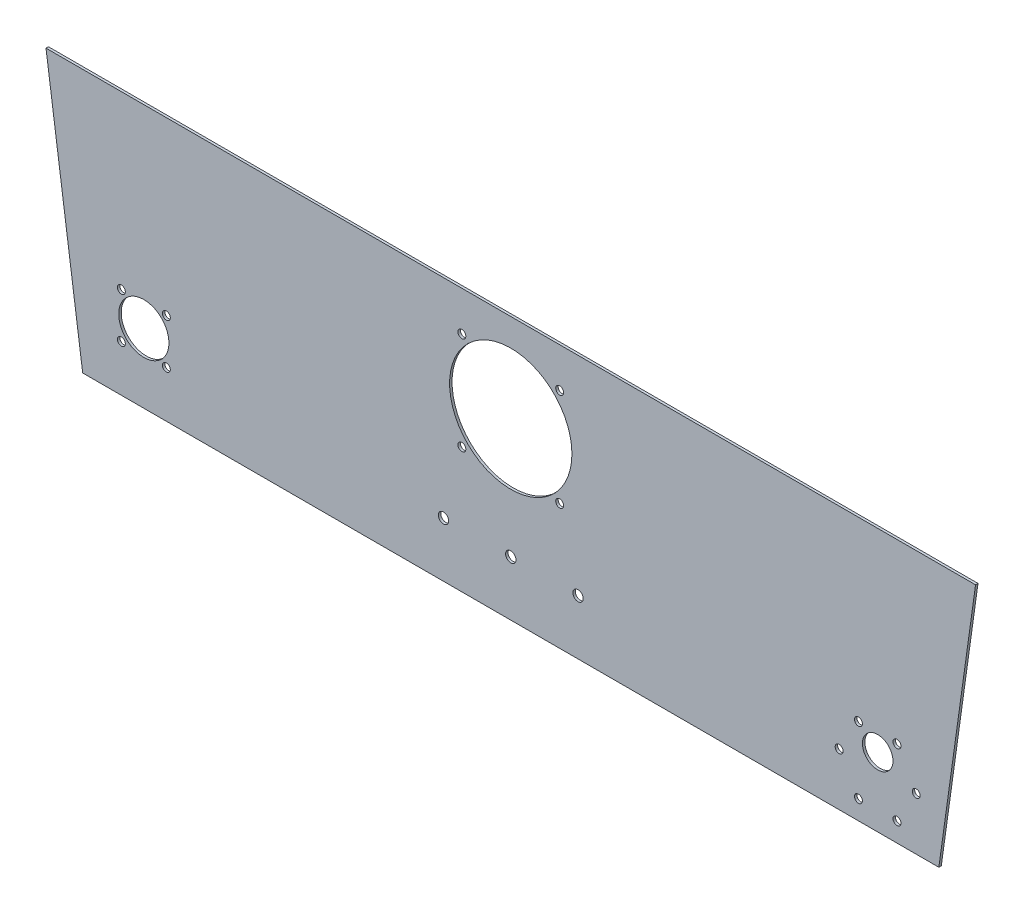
from build123d import *

# Parameters (mm, degrees)
SKETCH4_R           = 10.25
SKETCH4_R_2         = 6.25
SKETCH4_R_3         = 1.625
SKETCH4_R_4         = 2.125
BOSS_EXTRUDE2_DEPTH = 1
SKETCH5_R           = 1.625
SKETCH5_R_2         = 25
CUT_EXTRUDE1_DEPTH  = 10


with BuildPart() as part:
    # Sketch4 → Boss-Extrude2 (new body)
    with BuildSketch(Plane.XY):
        Polygon((-150.217936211, -37.769103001), (199.782063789, -37.769103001), (214.786249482, 69.739944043), (-165.213750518, 69.739944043), align=None)
        with Locations((-125.217936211, -9.519103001)):
            Circle(SKETCH4_R, mode=Mode.SUBTRACT)
        with Locations((174.782063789, -9.519103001)):
            Circle(SKETCH4_R_2, mode=Mode.SUBTRACT)
        with Locations((-116.025548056, -0.326714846)):
            Circle(SKETCH4_R_3, mode=Mode.SUBTRACT)
        with Locations((-134.410324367, -18.711491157)):
            Circle(SKETCH4_R_3, mode=Mode.SUBTRACT)
        with Locations(Location((-116.025548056, -18.711491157, 0), (0, 0, 180))):
            Circle(SKETCH4_R_3, mode=Mode.SUBTRACT)
        with Locations(Location((-134.410324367, -0.326714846, 0), (0, 0, 180))):
            Circle(SKETCH4_R_3, mode=Mode.SUBTRACT)
        with Locations((159.032063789, -16.271628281)):
            Circle(SKETCH4_R_3, mode=Mode.SUBTRACT)
        with Locations((166.907063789, -2.631728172)):
            Circle(SKETCH4_R_3, mode=Mode.SUBTRACT)
        with Locations((182.657063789, -2.631728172)):
            Circle(SKETCH4_R_3, mode=Mode.SUBTRACT)
        with Locations((190.532063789, -16.271628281)):
            Circle(SKETCH4_R_3, mode=Mode.SUBTRACT)
        with Locations((182.657063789, -29.911528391)):
            Circle(SKETCH4_R_3, mode=Mode.SUBTRACT)
        with Locations((166.907063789, -29.911528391)):
            Circle(SKETCH4_R_3, mode=Mode.SUBTRACT)
        with Locations((24.782063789, -15.359103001)):
            Circle(SKETCH4_R_4, mode=Mode.SUBTRACT)
        with Locations((-2.717936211, -15.359103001)):
            Circle(SKETCH4_R_4, mode=Mode.SUBTRACT)
        with Locations((52.282063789, -15.359103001)):
            Circle(SKETCH4_R_4, mode=Mode.SUBTRACT)
    extrude(amount=BOSS_EXTRUDE2_DEPTH)

    # Sketch5 → Cut-Extrude1 (cut)
    with BuildSketch(Plane.XY.offset(1)):
        with Locations((4.784840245, 53.543866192)):
            Circle(SKETCH5_R)
        with Locations((44.784840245, 53.543866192)):
            Circle(SKETCH5_R)
        with Locations((4.784840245, 13.543866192)):
            Circle(SKETCH5_R)
        with Locations((44.784840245, 13.543866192)):
            Circle(SKETCH5_R)
        with Locations((24.784840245, 33.543866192)):
            Circle(SKETCH5_R_2)
    extrude(amount=-CUT_EXTRUDE1_DEPTH, mode=Mode.SUBTRACT)


solid = part.part
